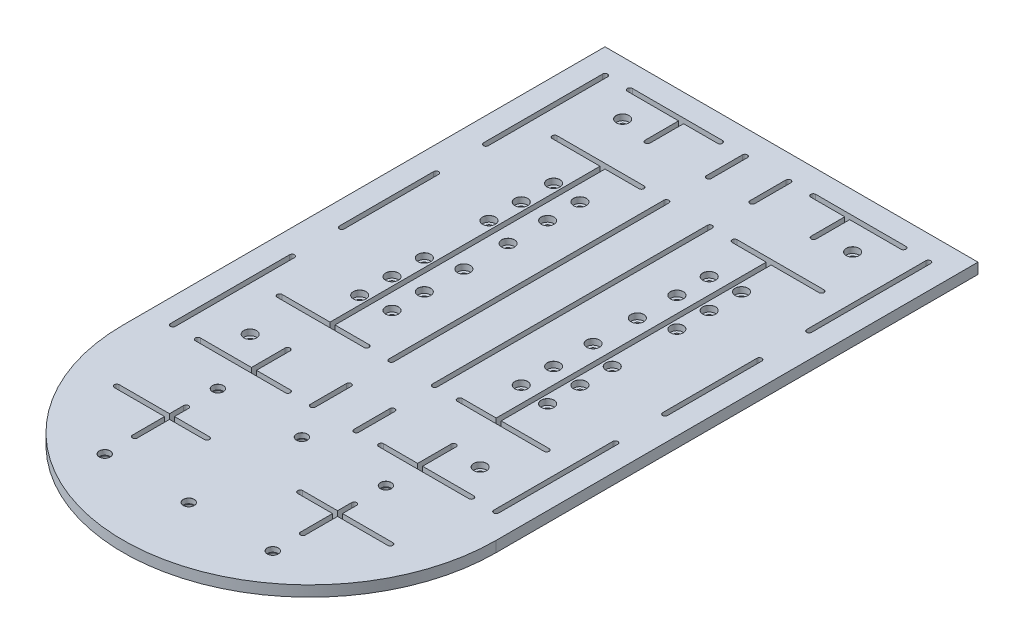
from build123d import *

# Parameters (mm, degrees)
BOSS_EXTRUDE1_DEPTH             = 5.461
CUT_EXTRUDE1_DEPTH              = 239.220673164
SKETCH3_R                       = 2.34315
CUT_EXTRUDE2_DEPTH              = 239.220673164
CBORE_FOR_M3_SHCS1_AT_2_COUNT   = 2
CBORE_FOR_M3_SHCS1_AT_2_PITCH   = 15.062651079
CBORE_FOR_M3_SHCS1_AT_3_COUNT   = 2
CBORE_FOR_M3_SHCS1_AT_3_PITCH   = 23.438162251
CBORE_FOR_M3_SHCS1_AT_4_COUNT   = 2
CBORE_FOR_M3_SHCS1_AT_4_PITCH   = 16.50365
CBORE_FOR_M3_SHCS1_AT_5_COUNT   = 2
CBORE_FOR_M3_SHCS1_AT_5_PITCH   = 33.0073
CBORE_FOR_M3_SHCS1_AT_6_COUNT   = 2
CBORE_FOR_M3_SHCS1_AT_6_PITCH   = 41.052649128
CBORE_FOR_M3_SHCS1_AT_7_COUNT   = 2
CBORE_FOR_M3_SHCS1_AT_7_PITCH   = 81.014816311
CBORE_FOR_M3_SHCS1_AT_8_COUNT   = 2
CBORE_FOR_M3_SHCS1_AT_8_PITCH   = 95.9866
CBORE_FOR_M3_SHCS1_AT_9_COUNT   = 2
CBORE_FOR_M3_SHCS1_AT_9_PITCH   = 97.39506067
CBORE_FOR_M3_SHCS1_AT_10_COUNT  = 2
CBORE_FOR_M3_SHCS1_AT_10_PITCH  = 82.981109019
CBORE_FOR_M3_SHCS1_AT_11_COUNT  = 2
CBORE_FOR_M3_SHCS1_AT_11_PITCH  = 89.564708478
CBORE_FOR_M3_SHCS1_AT_12_COUNT  = 2
CBORE_FOR_M3_SHCS1_AT_12_PITCH  = 101.503247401
CBORE_FOR_M3_SHCS1_AT_13_COUNT  = 2
CBORE_FOR_M3_SHCS1_AT_13_PITCH  = 101.281852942
CBORE_FOR_M3_SHCS1_AT_14_COUNT  = 2
CBORE_FOR_M3_SHCS1_AT_14_PITCH  = 116.496157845
CBORE_FOR_M3_SHCS1_AT_15_COUNT  = 2
CBORE_FOR_M3_SHCS1_AT_15_PITCH  = 114.55214708
CBORE_FOR_M3_SHCS1_AT_16_COUNT  = 2
CBORE_FOR_M3_SHCS1_AT_16_PITCH  = 126.580760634
CBORE_FOR_M3_SHCS1_AT_17_COUNT  = 2
CBORE_FOR_M3_SHCS1_AT_17_PITCH  = 137.908535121
CBORE_FOR_M3_SHCS1_AT_18_COUNT  = 2
CBORE_FOR_M3_SHCS1_AT_18_PITCH  = 126.760309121
CBORE_FOR_M3_SHCS1_AT_19_COUNT  = 2
CBORE_FOR_M3_SHCS1_AT_19_PITCH  = 62.621855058
CBORE_FOR_M3_SHCS1_AT_20_COUNT  = 2
CBORE_FOR_M3_SHCS1_AT_20_PITCH  = 66.0146
CBORE_FOR_M3_SHCS1_AT_21_COUNT  = 2
CBORE_FOR_M3_SHCS1_AT_21_PITCH  = 82.51825
CBORE_FOR_M3_SHCS1_AT_22_COUNT  = 2
CBORE_FOR_M3_SHCS1_AT_22_PITCH  = 82.375223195
CBORE_FOR_M3_SHCS1_AT_23_COUNT  = 2
CBORE_FOR_M3_SHCS1_AT_23_PITCH  = 98.649171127
CBORE_FOR_M3_SHCS1_AT_24_COUNT  = 2
CBORE_FOR_M3_SHCS1_AT_24_PITCH  = 99.0219
CBORE_FOR_M3_SHCS2_AT_2_COUNT   = 2
CBORE_FOR_M3_SHCS2_AT_2_PITCH   = 117.475
CBORE_FOR_M3_SHCS2_AT_3_COUNT   = 2
CBORE_FOR_M3_SHCS2_AT_3_PITCH   = 223.58238762
CBORE_FOR_M3_SHCS2_AT_4_COUNT   = 2
CBORE_FOR_M3_SHCS2_AT_4_PITCH   = 190.2333
CBORE_FOR_M2_5_SHCS1_AT_2_COUNT = 2
CBORE_FOR_M2_5_SHCS1_AT_2_PITCH = 42.90695
CBORE_FOR_M2_5_SHCS1_AT_3_COUNT = 2
CBORE_FOR_M2_5_SHCS1_AT_3_PITCH = 85.8139
CBORE_FOR_M2_5_SHCS1_AT_4_COUNT = 2
CBORE_FOR_M2_5_SHCS1_AT_4_PITCH = 103.448847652
CBORE_FOR_M2_5_SHCS1_AT_5_COUNT = 2
CBORE_FOR_M2_5_SHCS1_AT_5_PITCH = 71.96280293
CBORE_FOR_M2_5_SHCS1_AT_6_COUNT = 2
CBORE_FOR_M2_5_SHCS1_AT_6_PITCH = 57.7723


with BuildPart() as part:
    # Sketch1 → Boss-Extrude1 (new body)
    with BuildSketch(Plane(origin=(0, 0, 0), x_dir=(1, 0, 0), z_dir=(0, 1, 0))):
        with BuildLine():
            Line((-95.25, -123.03125), (-95.25, 123.03125))
            Line((-95.25, 123.03125), (95.25, 123.03125))
            Line((95.25, 123.03125), (95.25, -123.03125))
            ThreePointArc((95.25, -123.03125), (0, -218.28125), (-95.25, -123.03125))
        make_face()
    extrude(amount=BOSS_EXTRUDE1_DEPTH)

    # Sketch2 → Cut-Extrude1 (cut, through all)
    with BuildSketch(Plane(origin=(0, 5.461, 0), x_dir=(1, 0, 0), z_dir=(0, 1, 0))):
        with BuildLine():
            Line((-41.1599888, -68.9412388), (-23.80488, -68.9412388))
            ThreePointArc((-23.80488, -68.9412388), (-22.53488, -70.2112388), (-23.80488, -71.4812388))
            Line((-23.80488, -71.4812388), (-41.1599888, -71.4812388))
            Line((-41.1599888, -71.4812388), (-43.6999888, -71.4812388))
            Line((-43.6999888, -71.4812388), (-68.154697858, -71.4812388))
            ThreePointArc((-68.154697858, -71.4812388), (-69.424697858, -70.2112388), (-68.154697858, -68.9412388))
            Line((-68.154697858, -68.9412388), (-43.6999888, -68.9412388))
            Line((-43.6999888, -68.9412388), (-43.6999888, 68.9412388))
            Line((-43.6999888, 68.9412388), (-68.154697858, 68.9412388))
            ThreePointArc((-68.154697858, 68.9412388), (-69.424697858, 70.2112388), (-68.154697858, 71.4812388))
            Line((-68.154697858, 71.4812388), (-43.6999888, 71.4812388))
            Line((-43.6999888, 71.4812388), (-41.1599888, 71.4812388))
            Line((-41.1599888, 71.4812388), (-23.80488, 71.4812388))
            ThreePointArc((-23.80488, 71.4812388), (-22.53488, 70.2112388), (-23.80488, 68.9412388))
            Line((-23.80488, 68.9412388), (-41.1599888, 68.9412388))
            Line((-41.1599888, 68.9412388), (-41.1599888, -68.9412388))
        make_face()
        with BuildLine():
            Line((-81.28, 110.33125), (-81.28, 49.47793))
            ThreePointArc((-81.28, 49.47793), (-82.55, 48.20793), (-83.82, 49.47793))
            Line((-83.82, 49.47793), (-83.82, 110.33125))
            ThreePointArc((-83.82, 110.33125), (-82.55, 111.60125), (-81.28, 110.33125))
        make_face()
        with BuildLine():
            Line((-69.85, 111.60125), (-23.80488, 111.60125))
            ThreePointArc((-23.80488, 111.60125), (-22.53488, 110.33125), (-23.80488, 109.06125))
            Line((-23.80488, 109.06125), (-41.1599888, 109.06125))
            Line((-41.1599888, 109.06125), (-41.1599888, 91.935537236))
            ThreePointArc((-41.1599888, 91.935537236), (-42.4299888, 90.665537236), (-43.6999888, 91.935537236))
            Line((-43.6999888, 91.935537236), (-43.6999888, 109.06125))
            Line((-43.6999888, 109.06125), (-69.85, 109.06125))
            ThreePointArc((-69.85, 109.06125), (-71.12, 110.33125), (-69.85, 111.60125))
        make_face()
        with BuildLine():
            Line((-12.37488, 91.935537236), (-12.37488, 110.33125))
            ThreePointArc((-12.37488, 110.33125), (-11.10488, 111.60125), (-9.83488, 110.33125))
            Line((-9.83488, 110.33125), (-9.83488, 91.935537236))
            ThreePointArc((-9.83488, 91.935537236), (-11.10488, 90.665537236), (-12.37488, 91.935537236))
        make_face()
        with BuildLine():
            Line((-83.82, -24.07793), (-83.82, 24.07793))
            ThreePointArc((-83.82, 24.07793), (-82.55, 25.34793), (-81.28, 24.07793))
            Line((-81.28, 24.07793), (-81.28, -24.07793))
            ThreePointArc((-81.28, -24.07793), (-82.55, -25.34793), (-83.82, -24.07793))
        make_face()
        with BuildLine():
            Line((-9.83488, 70.2112388), (-9.83488, -70.2112388))
            ThreePointArc((-9.83488, -70.2112388), (-11.10488, -71.4812388), (-12.37488, -70.2112388))
            Line((-12.37488, -70.2112388), (-12.37488, 70.2112388))
            ThreePointArc((-12.37488, 70.2112388), (-11.10488, 71.4812388), (-9.83488, 70.2112388))
        make_face()
        with BuildLine():
            Line((-12.37488, -91.935537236), (-12.37488, -110.33125))
            ThreePointArc((-12.37488, -110.33125), (-11.10488, -111.60125), (-9.83488, -110.33125))
            Line((-9.83488, -110.33125), (-9.83488, -91.935537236))
            ThreePointArc((-9.83488, -91.935537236), (-11.10488, -90.665537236), (-12.37488, -91.935537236))
        make_face()
        with BuildLine():
            Line((-69.85, -111.60125), (-23.80488, -111.60125))
            ThreePointArc((-23.80488, -111.60125), (-22.53488, -110.33125), (-23.80488, -109.06125))
            Line((-23.80488, -109.06125), (-41.1599888, -109.06125))
            Line((-41.1599888, -109.06125), (-41.1599888, -91.935537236))
            ThreePointArc((-41.1599888, -91.935537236), (-42.4299888, -90.665537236), (-43.6999888, -91.935537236))
            Line((-43.6999888, -91.935537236), (-43.6999888, -109.06125))
            Line((-43.6999888, -109.06125), (-69.85, -109.06125))
            ThreePointArc((-69.85, -109.06125), (-71.12, -110.33125), (-69.85, -111.60125))
        make_face()
        with BuildLine():
            Line((-81.28, -110.33125), (-81.28, -49.47793))
            ThreePointArc((-81.28, -49.47793), (-82.55, -48.20793), (-83.82, -49.47793))
            Line((-83.82, -49.47793), (-83.82, -110.33125))
            ThreePointArc((-83.82, -110.33125), (-82.55, -111.60125), (-81.28, -110.33125))
        make_face()
        with BuildLine():
            Line((69.85, 111.60125), (23.80488, 111.60125))
            ThreePointArc((23.80488, 111.60125), (22.53488, 110.33125), (23.80488, 109.06125))
            Line((23.80488, 109.06125), (41.1599888, 109.06125))
            Line((41.1599888, 109.06125), (41.1599888, 91.935537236))
            ThreePointArc((41.1599888, 91.935537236), (42.4299888, 90.665537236), (43.6999888, 91.935537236))
            Line((43.6999888, 91.935537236), (43.6999888, 109.06125))
            Line((43.6999888, 109.06125), (69.85, 109.06125))
            ThreePointArc((69.85, 109.06125), (71.12, 110.33125), (69.85, 111.60125))
        make_face()
        with BuildLine():
            Line((12.37488, 91.935537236), (12.37488, 110.33125))
            ThreePointArc((12.37488, 110.33125), (11.10488, 111.60125), (9.83488, 110.33125))
            Line((9.83488, 110.33125), (9.83488, 91.935537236))
            ThreePointArc((9.83488, 91.935537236), (11.10488, 90.665537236), (12.37488, 91.935537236))
        make_face()
        with BuildLine():
            Line((41.1599888, 68.9412388), (23.80488, 68.9412388))
            ThreePointArc((23.80488, 68.9412388), (22.53488, 70.2112388), (23.80488, 71.4812388))
            Line((23.80488, 71.4812388), (41.1599888, 71.4812388))
            Line((41.1599888, 71.4812388), (43.6999888, 71.4812388))
            Line((43.6999888, 71.4812388), (68.154697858, 71.4812388))
            ThreePointArc((68.154697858, 71.4812388), (69.424697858, 70.2112388), (68.154697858, 68.9412388))
            Line((68.154697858, 68.9412388), (43.6999888, 68.9412388))
            Line((43.6999888, 68.9412388), (43.6999888, -68.9412388))
            Line((43.6999888, -68.9412388), (68.154697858, -68.9412388))
            ThreePointArc((68.154697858, -68.9412388), (69.424697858, -70.2112388), (68.154697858, -71.4812388))
            Line((68.154697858, -71.4812388), (43.6999888, -71.4812388))
            Line((43.6999888, -71.4812388), (41.1599888, -71.4812388))
            Line((41.1599888, -71.4812388), (23.80488, -71.4812388))
            ThreePointArc((23.80488, -71.4812388), (22.53488, -70.2112388), (23.80488, -68.9412388))
            Line((23.80488, -68.9412388), (41.1599888, -68.9412388))
            Line((41.1599888, -68.9412388), (41.1599888, 68.9412388))
        make_face()
        with BuildLine():
            Line((81.28, 110.33125), (81.28, 49.47793))
            ThreePointArc((81.28, 49.47793), (82.55, 48.20793), (83.82, 49.47793))
            Line((83.82, 49.47793), (83.82, 110.33125))
            ThreePointArc((83.82, 110.33125), (82.55, 111.60125), (81.28, 110.33125))
        make_face()
        with BuildLine():
            Line((12.37488, 70.2112388), (12.37488, -70.2112388))
            ThreePointArc((12.37488, -70.2112388), (11.10488, -71.4812388), (9.83488, -70.2112388))
            Line((9.83488, -70.2112388), (9.83488, 70.2112388))
            ThreePointArc((9.83488, 70.2112388), (11.10488, 71.4812388), (12.37488, 70.2112388))
        make_face()
        with BuildLine():
            Line((81.28, -24.07793), (81.28, 24.07793))
            ThreePointArc((81.28, 24.07793), (82.55, 25.34793), (83.82, 24.07793))
            Line((83.82, 24.07793), (83.82, -24.07793))
            ThreePointArc((83.82, -24.07793), (82.55, -25.34793), (81.28, -24.07793))
        make_face()
        with BuildLine():
            Line((12.37488, -91.935537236), (12.37488, -110.33125))
            ThreePointArc((12.37488, -110.33125), (11.10488, -111.60125), (9.83488, -110.33125))
            Line((9.83488, -110.33125), (9.83488, -91.935537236))
            ThreePointArc((9.83488, -91.935537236), (11.10488, -90.665537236), (12.37488, -91.935537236))
        make_face()
        with BuildLine():
            Line((81.28, -110.33125), (81.28, -49.47793))
            ThreePointArc((81.28, -49.47793), (82.55, -48.20793), (83.82, -49.47793))
            Line((83.82, -49.47793), (83.82, -110.33125))
            ThreePointArc((83.82, -110.33125), (82.55, -111.60125), (81.28, -110.33125))
        make_face()
        with BuildLine():
            Line((69.85, -111.60125), (23.80488, -111.60125))
            ThreePointArc((23.80488, -111.60125), (22.53488, -110.33125), (23.80488, -109.06125))
            Line((23.80488, -109.06125), (41.1599888, -109.06125))
            Line((41.1599888, -109.06125), (41.1599888, -91.935537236))
            ThreePointArc((41.1599888, -91.935537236), (42.4299888, -90.665537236), (43.6999888, -91.935537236))
            Line((43.6999888, -91.935537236), (43.6999888, -109.06125))
            Line((43.6999888, -109.06125), (69.85, -109.06125))
            ThreePointArc((69.85, -109.06125), (71.12, -110.33125), (69.85, -111.60125))
        make_face()
    extrude(amount=-CUT_EXTRUDE1_DEPTH, mode=Mode.SUBTRACT)

    # Sketch3 → Cut-Extrude2 (cut, through all)
    with BuildSketch(Plane(origin=(0, 5.461, 0), x_dir=(1, 0, 0), z_dir=(0, 1, 0))):
        with Locations(Location((-42.90695, -127.01940052, 0), (0, 0, 270))):
            Circle(SKETCH3_R)
        with Locations(Location((0, -127.01940052, 0), (0, 0, 270))):
            Circle(SKETCH3_R)
        with Locations(Location((42.90695, -127.01940052, 0), (0, 0, 270))):
            Circle(SKETCH3_R)
        with Locations(Location((-42.90695, -184.79170052, 0), (0, 0, 270))):
            Circle(SKETCH3_R)
        with Locations(Location((0, -184.79170052, 0), (0, 0, 270))):
            Circle(SKETCH3_R)
        with Locations(Location((42.90695, -184.79170052, 0), (0, 0, 270))):
            Circle(SKETCH3_R)
        with BuildLine():
            Line((-44.17695, -152.99125104), (-44.17695, -169.442535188))
            ThreePointArc((-44.17695, -169.442535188), (-42.90695, -170.712535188), (-41.63695, -169.442535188))
            Line((-41.63695, -169.442535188), (-41.63695, -152.99125104))
            Line((-41.63695, -152.99125104), (-23.80488, -152.99125104))
            ThreePointArc((-23.80488, -152.99125104), (-22.53488, -151.72125104), (-23.80488, -150.45125104))
            Line((-23.80488, -150.45125104), (-41.63695, -150.45125104))
            Line((-41.63695, -150.45125104), (-41.63695, -143.280535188))
            ThreePointArc((-41.63695, -143.280535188), (-42.90695, -142.010535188), (-44.17695, -143.280535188))
            Line((-44.17695, -143.280535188), (-44.17695, -150.45125104))
            Line((-44.17695, -150.45125104), (-69.85, -150.45125104))
            ThreePointArc((-69.85, -150.45125104), (-71.12, -151.72125104), (-69.85, -152.99125104))
            Line((-69.85, -152.99125104), (-44.17695, -152.99125104))
        make_face()
        with BuildLine():
            Line((41.63695, -143.280535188), (41.63695, -150.45125104))
            Line((41.63695, -150.45125104), (23.80488, -150.45125104))
            ThreePointArc((23.80488, -150.45125104), (22.53488, -151.72125104), (23.80488, -152.99125104))
            Line((23.80488, -152.99125104), (41.63695, -152.99125104))
            Line((41.63695, -152.99125104), (41.63695, -169.442535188))
            ThreePointArc((41.63695, -169.442535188), (42.90695, -170.712535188), (44.17695, -169.442535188))
            Line((44.17695, -169.442535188), (44.17695, -152.99125104))
            Line((44.17695, -152.99125104), (69.85, -152.99125104))
            ThreePointArc((69.85, -152.99125104), (71.12, -151.72125104), (69.85, -150.45125104))
            Line((69.85, -150.45125104), (44.17695, -150.45125104))
            Line((44.17695, -150.45125104), (44.17695, -143.280535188))
            ThreePointArc((44.17695, -143.280535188), (42.90695, -142.010535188), (41.63695, -143.280535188))
        make_face()
    extrude(amount=-CUT_EXTRUDE2_DEPTH, mode=Mode.SUBTRACT)

    # Sketch8 → CBORE for M3 SHCS1 (revolve, cut)
    with BuildSketch(Plane(origin=(-47.9933, 5.461, -49.51095), x_dir=(0, 0, 1), z_dir=(1, 0, 0))):
        Polygon((0, 0), (0, 5.461), (1.7, 5.461), (1.7, 3), (3.25, 3), (3.25, 0.025), (3.275, 0), align=None)
    cbore_for_m3_shcs1 = revolve(axis=Axis((-47.9933, 11.811, -49.51095), (0, -1, 0)), mode=Mode.SUBTRACT)

    # CBORE for M3 SHCS1 at 2: CBORE for M3 SHCS1 ×2
    with Locations(*[Vector(0.9949111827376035, 0, 0.10075583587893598) * (i * CBORE_FOR_M3_SHCS1_AT_2_PITCH) for i in range(1, CBORE_FOR_M3_SHCS1_AT_2_COUNT)]):
        add(cbore_for_m3_shcs1, mode=Mode.SUBTRACT)

    # CBORE for M3 SHCS1 at 3: CBORE for M3 SHCS1 ×2
    with Locations(*[Vector(0.6393846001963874, 0, 0.7688870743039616) * (i * CBORE_FOR_M3_SHCS1_AT_3_PITCH) for i in range(1, CBORE_FOR_M3_SHCS1_AT_3_COUNT)]):
        add(cbore_for_m3_shcs1, mode=Mode.SUBTRACT)

    # CBORE for M3 SHCS1 at 4: CBORE for M3 SHCS1 ×2
    with Locations(*[(0, 0, i * CBORE_FOR_M3_SHCS1_AT_4_PITCH) for i in range(1, CBORE_FOR_M3_SHCS1_AT_4_COUNT)]):
        add(cbore_for_m3_shcs1, mode=Mode.SUBTRACT)

    # CBORE for M3 SHCS1 at 5: CBORE for M3 SHCS1 ×2
    with Locations(*[(0, 0, i * CBORE_FOR_M3_SHCS1_AT_5_PITCH) for i in range(1, CBORE_FOR_M3_SHCS1_AT_5_COUNT)]):
        add(cbore_for_m3_shcs1, mode=Mode.SUBTRACT)

    # CBORE for M3 SHCS1 at 6: CBORE for M3 SHCS1 ×2
    with Locations(*[Vector(0.36504343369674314, 0, 0.9309904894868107) * (i * CBORE_FOR_M3_SHCS1_AT_6_PITCH) for i in range(1, CBORE_FOR_M3_SHCS1_AT_6_COUNT)]):
        add(cbore_for_m3_shcs1, mode=Mode.SUBTRACT)

    # CBORE for M3 SHCS1 at 7: CBORE for M3 SHCS1 ×2
    with Locations(*[Vector(0.999824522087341, 0, 0.01873299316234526) * (i * CBORE_FOR_M3_SHCS1_AT_7_PITCH) for i in range(1, CBORE_FOR_M3_SHCS1_AT_7_COUNT)]):
        add(cbore_for_m3_shcs1, mode=Mode.SUBTRACT)

    # CBORE for M3 SHCS1 at 8: CBORE for M3 SHCS1 ×2
    with Locations(*[(i * CBORE_FOR_M3_SHCS1_AT_8_PITCH, 0, 0) for i in range(1, CBORE_FOR_M3_SHCS1_AT_8_COUNT)]):
        add(cbore_for_m3_shcs1, mode=Mode.SUBTRACT)

    # CBORE for M3 SHCS1 at 9: CBORE for M3 SHCS1 ×2
    with Locations(*[Vector(0.9855386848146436, 0, 0.16945058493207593) * (i * CBORE_FOR_M3_SHCS1_AT_9_PITCH) for i in range(1, CBORE_FOR_M3_SHCS1_AT_9_COUNT)]):
        add(cbore_for_m3_shcs1, mode=Mode.SUBTRACT)

    # CBORE for M3 SHCS1 at 10: CBORE for M3 SHCS1 ×2
    with Locations(*[Vector(0.9761330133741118, 0, 0.21717352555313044) * (i * CBORE_FOR_M3_SHCS1_AT_10_PITCH) for i in range(1, CBORE_FOR_M3_SHCS1_AT_10_COUNT)]):
        add(cbore_for_m3_shcs1, mode=Mode.SUBTRACT)

    # CBORE for M3 SHCS1 at 11: CBORE for M3 SHCS1 ×2
    with Locations(*[Vector(0.9043807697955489, 0, 0.42672640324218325) * (i * CBORE_FOR_M3_SHCS1_AT_11_PITCH) for i in range(1, CBORE_FOR_M3_SHCS1_AT_11_COUNT)]):
        add(cbore_for_m3_shcs1, mode=Mode.SUBTRACT)

    # CBORE for M3 SHCS1 at 12: CBORE for M3 SHCS1 ×2
    with Locations(*[Vector(0.9456505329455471, 0, 0.3251846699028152) * (i * CBORE_FOR_M3_SHCS1_AT_12_PITCH) for i in range(1, CBORE_FOR_M3_SHCS1_AT_12_COUNT)]):
        add(cbore_for_m3_shcs1, mode=Mode.SUBTRACT)

    # CBORE for M3 SHCS1 at 13: CBORE for M3 SHCS1 ×2
    with Locations(*[Vector(0.7997543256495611, 0, 0.6003274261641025) * (i * CBORE_FOR_M3_SHCS1_AT_13_PITCH) for i in range(1, CBORE_FOR_M3_SHCS1_AT_13_COUNT)]):
        add(cbore_for_m3_shcs1, mode=Mode.SUBTRACT)

    # CBORE for M3 SHCS1 at 14: CBORE for M3 SHCS1 ×2
    with Locations(*[Vector(0.823946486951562, 0, 0.566667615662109) * (i * CBORE_FOR_M3_SHCS1_AT_14_PITCH) for i in range(1, CBORE_FOR_M3_SHCS1_AT_14_COUNT)]):
        add(cbore_for_m3_shcs1, mode=Mode.SUBTRACT)

    # CBORE for M3 SHCS1 at 15: CBORE for M3 SHCS1 ×2
    with Locations(*[Vector(0.7071067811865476, 0, 0.7071067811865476) * (i * CBORE_FOR_M3_SHCS1_AT_15_PITCH) for i in range(1, CBORE_FOR_M3_SHCS1_AT_15_COUNT)]):
        add(cbore_for_m3_shcs1, mode=Mode.SUBTRACT)

    # CBORE for M3 SHCS1 at 16: CBORE for M3 SHCS1 ×2
    with Locations(*[Vector(0.7583032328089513, 0, 0.6519019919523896) * (i * CBORE_FOR_M3_SHCS1_AT_16_PITCH) for i in range(1, CBORE_FOR_M3_SHCS1_AT_16_COUNT)]):
        add(cbore_for_m3_shcs1, mode=Mode.SUBTRACT)

    # CBORE for M3 SHCS1 at 17: CBORE for M3 SHCS1 ×2
    with Locations(*[Vector(0.6960163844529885, 0, 0.7180258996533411) * (i * CBORE_FOR_M3_SHCS1_AT_17_PITCH) for i in range(1, CBORE_FOR_M3_SHCS1_AT_17_COUNT)]):
        add(cbore_for_m3_shcs1, mode=Mode.SUBTRACT)

    # CBORE for M3 SHCS1 at 18: CBORE for M3 SHCS1 ×2
    with Locations(*[Vector(0.6390060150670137, 0, 0.7692017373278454) * (i * CBORE_FOR_M3_SHCS1_AT_18_PITCH) for i in range(1, CBORE_FOR_M3_SHCS1_AT_18_COUNT)]):
        add(cbore_for_m3_shcs1, mode=Mode.SUBTRACT)

    # CBORE for M3 SHCS1 at 19: CBORE for M3 SHCS1 ×2
    with Locations(*[Vector(0.23930942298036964, 0, 0.9709433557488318) * (i * CBORE_FOR_M3_SHCS1_AT_19_PITCH) for i in range(1, CBORE_FOR_M3_SHCS1_AT_19_COUNT)]):
        add(cbore_for_m3_shcs1, mode=Mode.SUBTRACT)

    # CBORE for M3 SHCS1 at 20: CBORE for M3 SHCS1 ×2
    with Locations(*[(0, 0, i * CBORE_FOR_M3_SHCS1_AT_20_PITCH) for i in range(1, CBORE_FOR_M3_SHCS1_AT_20_COUNT)]):
        add(cbore_for_m3_shcs1, mode=Mode.SUBTRACT)

    # CBORE for M3 SHCS1 at 21: CBORE for M3 SHCS1 ×2
    with Locations(*[(0, 0, i * CBORE_FOR_M3_SHCS1_AT_21_PITCH) for i in range(1, CBORE_FOR_M3_SHCS1_AT_21_COUNT)]):
        add(cbore_for_m3_shcs1, mode=Mode.SUBTRACT)

    # CBORE for M3 SHCS1 at 22: CBORE for M3 SHCS1 ×2
    with Locations(*[Vector(0.1819236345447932, 0, 0.9833126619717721) * (i * CBORE_FOR_M3_SHCS1_AT_22_PITCH) for i in range(1, CBORE_FOR_M3_SHCS1_AT_22_COUNT)]):
        add(cbore_for_m3_shcs1, mode=Mode.SUBTRACT)

    # CBORE for M3 SHCS1 at 23: CBORE for M3 SHCS1 ×2
    with Locations(*[Vector(0.15191207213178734, 0, 0.9883940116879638) * (i * CBORE_FOR_M3_SHCS1_AT_23_PITCH) for i in range(1, CBORE_FOR_M3_SHCS1_AT_23_COUNT)]):
        add(cbore_for_m3_shcs1, mode=Mode.SUBTRACT)

    # CBORE for M3 SHCS1 at 24: CBORE for M3 SHCS1 ×2
    with Locations(*[(0, 0, i * CBORE_FOR_M3_SHCS1_AT_24_PITCH) for i in range(1, CBORE_FOR_M3_SHCS1_AT_24_COUNT)]):
        add(cbore_for_m3_shcs1, mode=Mode.SUBTRACT)

    # Sketch9 → CBORE for M3 SHCS2 (revolve, cut)
    with BuildSketch(Plane(origin=(-58.7375, 5.461, -95.53575), x_dir=(0, 0, 1), z_dir=(1, 0, 0))):
        Polygon((0, 0), (0, 5.461), (1.7, 5.461), (1.7, 3), (3.25, 3), (3.25, 0.025), (3.275, 0), align=None)
    cbore_for_m3_shcs2 = revolve(axis=Axis((-58.7375, 11.811, -95.53575), (0, -1, 0)), mode=Mode.SUBTRACT)

    # CBORE for M3 SHCS2 at 2: CBORE for M3 SHCS2 ×2
    with Locations(*[(i * CBORE_FOR_M3_SHCS2_AT_2_PITCH, 0, 0) for i in range(1, CBORE_FOR_M3_SHCS2_AT_2_COUNT)]):
        add(cbore_for_m3_shcs2, mode=Mode.SUBTRACT)

    # CBORE for M3 SHCS2 at 3: CBORE for M3 SHCS2 ×2
    with Locations(*[Vector(0.525421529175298, 0, 0.8508420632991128) * (i * CBORE_FOR_M3_SHCS2_AT_3_PITCH) for i in range(1, CBORE_FOR_M3_SHCS2_AT_3_COUNT)]):
        add(cbore_for_m3_shcs2, mode=Mode.SUBTRACT)

    # CBORE for M3 SHCS2 at 4: CBORE for M3 SHCS2 ×2
    with Locations(*[(0, 0, i * CBORE_FOR_M3_SHCS2_AT_4_PITCH) for i in range(1, CBORE_FOR_M3_SHCS2_AT_4_COUNT)]):
        add(cbore_for_m3_shcs2, mode=Mode.SUBTRACT)

    # Sketch10 → CBORE for M2.5 SHCS1 (revolve, cut)
    with BuildSketch(Plane(origin=(-42.90695, 5.461, 184.79170052), x_dir=(0, 0, 1), z_dir=(1, 0, 0))):
        Polygon((0, 0), (0, 5.461), (1.45, 5.461), (1.45, 2.5), (2.75, 2.5), (2.75, 0.025), (2.775, 0), align=None)
    cbore_for_m2_5_shcs1 = revolve(axis=Axis((-42.90695, 11.811, 184.79170052), (0, -1, 0)), mode=Mode.SUBTRACT)

    # CBORE for M2.5 SHCS1 at 2: CBORE for M2.5 SHCS1 ×2
    with Locations(*[(i * CBORE_FOR_M2_5_SHCS1_AT_2_PITCH, 0, 0) for i in range(1, CBORE_FOR_M2_5_SHCS1_AT_2_COUNT)]):
        add(cbore_for_m2_5_shcs1, mode=Mode.SUBTRACT)

    # CBORE for M2.5 SHCS1 at 3: CBORE for M2.5 SHCS1 ×2
    with Locations(*[(i * CBORE_FOR_M2_5_SHCS1_AT_3_PITCH, 0, 0) for i in range(1, CBORE_FOR_M2_5_SHCS1_AT_3_COUNT)]):
        add(cbore_for_m2_5_shcs1, mode=Mode.SUBTRACT)

    # CBORE for M2.5 SHCS1 at 4: CBORE for M2.5 SHCS1 ×2
    with Locations(*[Vector(0.8295297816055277, 0, -0.5584624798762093) * (i * CBORE_FOR_M2_5_SHCS1_AT_4_PITCH) for i in range(1, CBORE_FOR_M2_5_SHCS1_AT_4_COUNT)]):
        add(cbore_for_m2_5_shcs1, mode=Mode.SUBTRACT)

    # CBORE for M2.5 SHCS1 at 5: CBORE for M2.5 SHCS1 ×2
    with Locations(*[Vector(0.5962378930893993, 0, -0.8028078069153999) * (i * CBORE_FOR_M2_5_SHCS1_AT_5_PITCH) for i in range(1, CBORE_FOR_M2_5_SHCS1_AT_5_COUNT)]):
        add(cbore_for_m2_5_shcs1, mode=Mode.SUBTRACT)

    # CBORE for M2.5 SHCS1 at 6: CBORE for M2.5 SHCS1 ×2
    with Locations(*[(0, 0, -i * CBORE_FOR_M2_5_SHCS1_AT_6_PITCH) for i in range(1, CBORE_FOR_M2_5_SHCS1_AT_6_COUNT)]):
        add(cbore_for_m2_5_shcs1, mode=Mode.SUBTRACT)


solid = part.part
